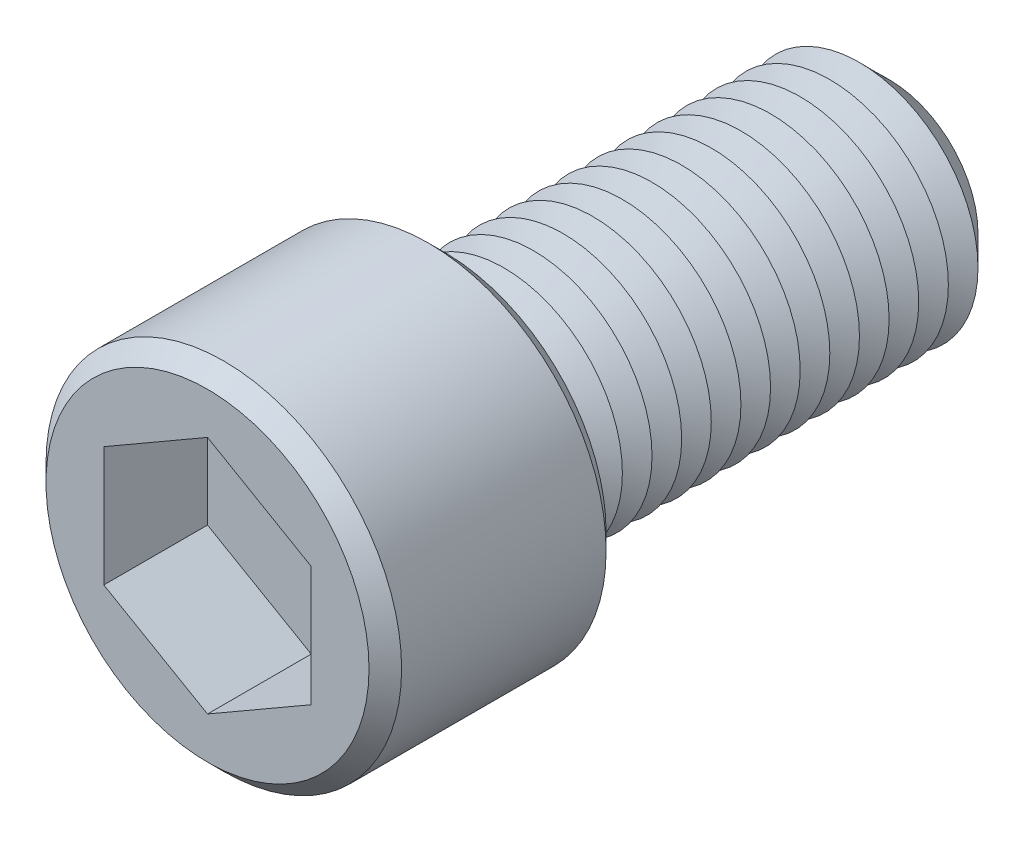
ISO-10303-21;
HEADER;
FILE_DESCRIPTION(('STEP AP214'),'2;1');
FILE_NAME('part.step','',(''),(''),'','','');
FILE_SCHEMA(('AUTOMOTIVE_DESIGN { 1 0 10303 214 1 1 1 1 }'));
ENDSEC;
DATA;
#1=APPLICATION_CONTEXT('core data for automotive mechanical design processes');
#2=APPLICATION_PROTOCOL_DEFINITION('international standard','automotive_design',2000,#1);
#3=PRODUCT_CONTEXT('',#1,'mechanical');
#4=PRODUCT('Part','Part','',(#3));
#5=PRODUCT_RELATED_PRODUCT_CATEGORY('part','',(#4));
#6=PRODUCT_DEFINITION_FORMATION('','',#4);
#7=PRODUCT_DEFINITION_CONTEXT('part definition',#1,'design');
#8=PRODUCT_DEFINITION('design','',#6,#7);
#9=PRODUCT_DEFINITION_SHAPE('','',#8);
#10=(LENGTH_UNIT() NAMED_UNIT(*) SI_UNIT(.MILLI.,.METRE.));
#11=(NAMED_UNIT(*) PLANE_ANGLE_UNIT() SI_UNIT($,.RADIAN.));
#12=(NAMED_UNIT(*) SI_UNIT($,.STERADIAN.) SOLID_ANGLE_UNIT());
#13=UNCERTAINTY_MEASURE_WITH_UNIT(LENGTH_MEASURE(1.E-05),#10,'distance_accuracy_value','');
#14=(GEOMETRIC_REPRESENTATION_CONTEXT(3) GLOBAL_UNCERTAINTY_ASSIGNED_CONTEXT((#13)) GLOBAL_UNIT_ASSIGNED_CONTEXT((#10,
#11,#12)) REPRESENTATION_CONTEXT('',''));
#15=CARTESIAN_POINT('',(0.,0.,0.));
#16=DIRECTION('',(0.,0.,1.));
#17=DIRECTION('',(1.,0.,0.));
#18=AXIS2_PLACEMENT_3D('',#15,#16,#17);
#19=CARTESIAN_POINT('',(0.,0.,16.));
#20=DIRECTION('',(0.,0.,-1.));
#21=DIRECTION('',(-1.,0.,0.));
#22=AXIS2_PLACEMENT_3D('',#19,#20,#21);
#23=CYLINDRICAL_SURFACE('',#22,12.);
#24=CARTESIAN_POINT('',(0.,0.,1.1));
#25=DIRECTION('',(0.,0.,1.));
#26=DIRECTION('',(1.,0.,0.));
#27=AXIS2_PLACEMENT_3D('',#24,#25,#26);
#28=CIRCLE('',#27,12.);
#29=CARTESIAN_POINT('',(12.,0.,1.1));
#30=VERTEX_POINT('',#29);
#31=EDGE_CURVE('E288',#30,#30,#28,.T.);
#32=ORIENTED_EDGE('',*,*,#31,.T.);
#33=EDGE_LOOP('',(#32));
#34=FACE_BOUND('',#33,.T.);
#35=CARTESIAN_POINT('',(0.,0.,14.9));
#36=DIRECTION('',(0.,0.,1.));
#37=DIRECTION('',(1.,0.,0.));
#38=AXIS2_PLACEMENT_3D('',#35,#36,#37);
#39=CIRCLE('',#38,12.);
#40=CARTESIAN_POINT('',(12.,0.,14.9));
#41=VERTEX_POINT('',#40);
#42=EDGE_CURVE('E284',#41,#41,#39,.F.);
#43=ORIENTED_EDGE('',*,*,#42,.T.);
#44=EDGE_LOOP('',(#43));
#45=FACE_BOUND('',#44,.T.);
#46=ADVANCED_FACE('F39',(#34,#45),#23,.T.);
#47=CARTESIAN_POINT('',(0.,0.,16.));
#48=DIRECTION('',(0.,0.,1.));
#49=DIRECTION('',(1.,0.,0.));
#50=AXIS2_PLACEMENT_3D('',#47,#48,#49);
#51=PLANE('',#50);
#52=CARTESIAN_POINT('',(0.,0.,16.));
#53=DIRECTION('',(0.,0.,1.));
#54=DIRECTION('',(1.,0.,0.));
#55=AXIS2_PLACEMENT_3D('',#52,#53,#54);
#56=CIRCLE('',#55,10.9);
#57=CARTESIAN_POINT('',(10.9,0.,16.));
#58=VERTEX_POINT('',#57);
#59=EDGE_CURVE('E11',#58,#58,#56,.T.);
#60=ORIENTED_EDGE('',*,*,#59,.T.);
#61=EDGE_LOOP('',(#60));
#62=FACE_BOUND('',#61,.T.);
#63=DIRECTION('',(-0.866025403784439,0.5,0.));
#64=VECTOR('',#63,1.);
#65=CARTESIAN_POINT('',(7.,4.04145188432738,16.));
#66=LINE('',#65,#64);
#67=CARTESIAN_POINT('',(7.,4.04145188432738,16.));
#68=VERTEX_POINT('',#67);
#69=CARTESIAN_POINT('',(0.,8.08290376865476,16.));
#70=VERTEX_POINT('',#69);
#71=EDGE_CURVE('E55',#68,#70,#66,.T.);
#72=ORIENTED_EDGE('',*,*,#71,.F.);
#73=DIRECTION('',(0.,1.,0.));
#74=VECTOR('',#73,1.);
#75=CARTESIAN_POINT('',(7.,-4.04145188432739,16.));
#76=LINE('',#75,#74);
#77=CARTESIAN_POINT('',(7.,-4.04145188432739,16.));
#78=VERTEX_POINT('',#77);
#79=EDGE_CURVE('E150',#78,#68,#76,.T.);
#80=ORIENTED_EDGE('',*,*,#79,.F.);
#81=DIRECTION('',(0.866025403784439,0.5,0.));
#82=VECTOR('',#81,1.);
#83=CARTESIAN_POINT('',(0.,-8.08290376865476,16.));
#84=LINE('',#83,#82);
#85=CARTESIAN_POINT('',(0.,-8.08290376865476,16.));
#86=VERTEX_POINT('',#85);
#87=EDGE_CURVE('E147',#86,#78,#84,.T.);
#88=ORIENTED_EDGE('',*,*,#87,.F.);
#89=DIRECTION('',(0.866025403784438,-0.5,0.));
#90=VECTOR('',#89,1.);
#91=CARTESIAN_POINT('',(-7.,-4.04145188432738,16.));
#92=LINE('',#91,#90);
#93=CARTESIAN_POINT('',(-7.,-4.04145188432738,16.));
#94=VERTEX_POINT('',#93);
#95=EDGE_CURVE('E103',#94,#86,#92,.T.);
#96=ORIENTED_EDGE('',*,*,#95,.F.);
#97=DIRECTION('',(0.,-1.,0.));
#98=VECTOR('',#97,1.);
#99=CARTESIAN_POINT('',(-7.,4.04145188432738,16.));
#100=LINE('',#99,#98);
#101=CARTESIAN_POINT('',(-7.,4.04145188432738,16.));
#102=VERTEX_POINT('',#101);
#103=EDGE_CURVE('E141',#102,#94,#100,.T.);
#104=ORIENTED_EDGE('',*,*,#103,.F.);
#105=DIRECTION('',(-0.866025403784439,-0.5,0.));
#106=VECTOR('',#105,1.);
#107=CARTESIAN_POINT('',(0.,8.08290376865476,16.));
#108=LINE('',#107,#106);
#109=EDGE_CURVE('E136',#70,#102,#108,.T.);
#110=ORIENTED_EDGE('',*,*,#109,.F.);
#111=EDGE_LOOP('',(#72,#80,#88,#96,#104,#110));
#112=FACE_BOUND('',#111,.T.);
#113=ADVANCED_FACE('F306',(#62,#112),#51,.T.);
#114=CARTESIAN_POINT('',(0.,0.,0.));
#115=DIRECTION('',(0.,0.,1.));
#116=DIRECTION('',(1.,0.,0.));
#117=AXIS2_PLACEMENT_3D('',#114,#115,#116);
#118=PLANE('',#117);
#119=CARTESIAN_POINT('',(0.,0.,0.));
#120=DIRECTION('',(0.,0.,1.));
#121=DIRECTION('',(1.,0.,0.));
#122=AXIS2_PLACEMENT_3D('',#119,#120,#121);
#123=CIRCLE('',#122,10.9);
#124=CARTESIAN_POINT('',(10.9,0.,0.));
#125=VERTEX_POINT('',#124);
#126=EDGE_CURVE('E48',#125,#125,#123,.F.);
#127=ORIENTED_EDGE('',*,*,#126,.T.);
#128=EDGE_LOOP('',(#127));
#129=FACE_BOUND('',#128,.T.);
#130=CARTESIAN_POINT('',(0.,0.,0.));
#131=DIRECTION('',(0.,0.,1.));
#132=DIRECTION('',(1.,0.,0.));
#133=AXIS2_PLACEMENT_3D('',#130,#131,#132);
#134=CIRCLE('',#133,8.);
#135=CARTESIAN_POINT('',(8.,0.,0.));
#136=VERTEX_POINT('',#135);
#137=EDGE_CURVE('E276',#136,#136,#134,.T.);
#138=ORIENTED_EDGE('',*,*,#137,.T.);
#139=EDGE_LOOP('',(#138));
#140=FACE_BOUND('',#139,.T.);
#141=ADVANCED_FACE('F295',(#129,#140),#118,.F.);
#142=CARTESIAN_POINT('',(0.,0.,0.));
#143=DIRECTION('',(0.,0.,1.));
#144=DIRECTION('',(1.,0.,0.));
#145=AXIS2_PLACEMENT_3D('',#142,#143,#144);
#146=CONICAL_SURFACE('',#145,8.,1.0471975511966);
#147=CARTESIAN_POINT('',(0.,0.,-1.));
#148=DIRECTION('',(0.,0.,1.));
#149=DIRECTION('',(1.,0.,0.));
#150=AXIS2_PLACEMENT_3D('',#147,#148,#149);
#151=CIRCLE('',#150,6.26794919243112);
#152=CARTESIAN_POINT('',(6.26794919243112,0.,-1.));
#153=VERTEX_POINT('',#152);
#154=EDGE_CURVE('E272',#153,#153,#151,.T.);
#155=ORIENTED_EDGE('',*,*,#154,.T.);
#156=EDGE_LOOP('',(#155));
#157=FACE_BOUND('',#156,.T.);
#158=ORIENTED_EDGE('',*,*,#137,.F.);
#159=EDGE_LOOP('',(#158));
#160=FACE_BOUND('',#159,.T.);
#161=ADVANCED_FACE('F468',(#157,#160),#146,.T.);
#162=CARTESIAN_POINT('',(0.,0.,-1.));
#163=DIRECTION('',(0.,0.,-1.));
#164=DIRECTION('',(-1.,0.,0.));
#165=AXIS2_PLACEMENT_3D('',#162,#163,#164);
#166=CONICAL_SURFACE('',#165,6.26794919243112,1.0471975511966);
#167=CARTESIAN_POINT('',(0.,0.,-2.));
#168=DIRECTION('',(0.,0.,1.));
#169=DIRECTION('',(1.,0.,0.));
#170=AXIS2_PLACEMENT_3D('',#167,#168,#169);
#171=CIRCLE('',#170,8.);
#172=CARTESIAN_POINT('',(8.,0.,-2.));
#173=VERTEX_POINT('',#172);
#174=EDGE_CURVE('E268',#173,#173,#171,.T.);
#175=ORIENTED_EDGE('',*,*,#174,.T.);
#176=EDGE_LOOP('',(#175));
#177=FACE_BOUND('',#176,.T.);
#178=ORIENTED_EDGE('',*,*,#154,.F.);
#179=EDGE_LOOP('',(#178));
#180=FACE_BOUND('',#179,.T.);
#181=ADVANCED_FACE('F464',(#177,#180),#166,.T.);
#182=CARTESIAN_POINT('',(0.,0.,-2.));
#183=DIRECTION('',(0.,0.,1.));
#184=DIRECTION('',(1.,0.,0.));
#185=AXIS2_PLACEMENT_3D('',#182,#183,#184);
#186=CONICAL_SURFACE('',#185,8.,1.0471975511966);
#187=CARTESIAN_POINT('',(0.,0.,-3.));
#188=DIRECTION('',(0.,0.,1.));
#189=DIRECTION('',(1.,0.,0.));
#190=AXIS2_PLACEMENT_3D('',#187,#188,#189);
#191=CIRCLE('',#190,6.26794919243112);
#192=CARTESIAN_POINT('',(6.26794919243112,0.,-3.));
#193=VERTEX_POINT('',#192);
#194=EDGE_CURVE('E264',#193,#193,#191,.T.);
#195=ORIENTED_EDGE('',*,*,#194,.T.);
#196=EDGE_LOOP('',(#195));
#197=FACE_BOUND('',#196,.T.);
#198=ORIENTED_EDGE('',*,*,#174,.F.);
#199=EDGE_LOOP('',(#198));
#200=FACE_BOUND('',#199,.T.);
#201=ADVANCED_FACE('F460',(#197,#200),#186,.T.);
#202=CARTESIAN_POINT('',(0.,0.,-3.));
#203=DIRECTION('',(0.,0.,-1.));
#204=DIRECTION('',(-1.,0.,0.));
#205=AXIS2_PLACEMENT_3D('',#202,#203,#204);
#206=CONICAL_SURFACE('',#205,6.26794919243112,1.0471975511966);
#207=CARTESIAN_POINT('',(0.,0.,-4.));
#208=DIRECTION('',(0.,0.,1.));
#209=DIRECTION('',(1.,0.,0.));
#210=AXIS2_PLACEMENT_3D('',#207,#208,#209);
#211=CIRCLE('',#210,8.);
#212=CARTESIAN_POINT('',(8.,0.,-4.));
#213=VERTEX_POINT('',#212);
#214=EDGE_CURVE('E260',#213,#213,#211,.T.);
#215=ORIENTED_EDGE('',*,*,#214,.T.);
#216=EDGE_LOOP('',(#215));
#217=FACE_BOUND('',#216,.T.);
#218=ORIENTED_EDGE('',*,*,#194,.F.);
#219=EDGE_LOOP('',(#218));
#220=FACE_BOUND('',#219,.T.);
#221=ADVANCED_FACE('F456',(#217,#220),#206,.T.);
#222=CARTESIAN_POINT('',(0.,0.,-4.));
#223=DIRECTION('',(0.,0.,1.));
#224=DIRECTION('',(1.,0.,0.));
#225=AXIS2_PLACEMENT_3D('',#222,#223,#224);
#226=CONICAL_SURFACE('',#225,8.,1.0471975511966);
#227=CARTESIAN_POINT('',(0.,0.,-5.));
#228=DIRECTION('',(0.,0.,1.));
#229=DIRECTION('',(1.,0.,0.));
#230=AXIS2_PLACEMENT_3D('',#227,#228,#229);
#231=CIRCLE('',#230,6.26794919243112);
#232=CARTESIAN_POINT('',(6.26794919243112,0.,-5.));
#233=VERTEX_POINT('',#232);
#234=EDGE_CURVE('E256',#233,#233,#231,.T.);
#235=ORIENTED_EDGE('',*,*,#234,.T.);
#236=EDGE_LOOP('',(#235));
#237=FACE_BOUND('',#236,.T.);
#238=ORIENTED_EDGE('',*,*,#214,.F.);
#239=EDGE_LOOP('',(#238));
#240=FACE_BOUND('',#239,.T.);
#241=ADVANCED_FACE('F452',(#237,#240),#226,.T.);
#242=CARTESIAN_POINT('',(0.,0.,-5.));
#243=DIRECTION('',(0.,0.,-1.));
#244=DIRECTION('',(-1.,0.,0.));
#245=AXIS2_PLACEMENT_3D('',#242,#243,#244);
#246=CONICAL_SURFACE('',#245,6.26794919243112,1.0471975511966);
#247=CARTESIAN_POINT('',(0.,0.,-6.));
#248=DIRECTION('',(0.,0.,1.));
#249=DIRECTION('',(1.,0.,0.));
#250=AXIS2_PLACEMENT_3D('',#247,#248,#249);
#251=CIRCLE('',#250,8.);
#252=CARTESIAN_POINT('',(8.,0.,-6.));
#253=VERTEX_POINT('',#252);
#254=EDGE_CURVE('E252',#253,#253,#251,.T.);
#255=ORIENTED_EDGE('',*,*,#254,.T.);
#256=EDGE_LOOP('',(#255));
#257=FACE_BOUND('',#256,.T.);
#258=ORIENTED_EDGE('',*,*,#234,.F.);
#259=EDGE_LOOP('',(#258));
#260=FACE_BOUND('',#259,.T.);
#261=ADVANCED_FACE('F448',(#257,#260),#246,.T.);
#262=CARTESIAN_POINT('',(0.,0.,-6.));
#263=DIRECTION('',(0.,0.,1.));
#264=DIRECTION('',(1.,0.,0.));
#265=AXIS2_PLACEMENT_3D('',#262,#263,#264);
#266=CONICAL_SURFACE('',#265,8.,1.0471975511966);
#267=CARTESIAN_POINT('',(0.,0.,-7.));
#268=DIRECTION('',(0.,0.,1.));
#269=DIRECTION('',(1.,0.,0.));
#270=AXIS2_PLACEMENT_3D('',#267,#268,#269);
#271=CIRCLE('',#270,6.26794919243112);
#272=CARTESIAN_POINT('',(6.26794919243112,0.,-7.));
#273=VERTEX_POINT('',#272);
#274=EDGE_CURVE('E248',#273,#273,#271,.T.);
#275=ORIENTED_EDGE('',*,*,#274,.T.);
#276=EDGE_LOOP('',(#275));
#277=FACE_BOUND('',#276,.T.);
#278=ORIENTED_EDGE('',*,*,#254,.F.);
#279=EDGE_LOOP('',(#278));
#280=FACE_BOUND('',#279,.T.);
#281=ADVANCED_FACE('F444',(#277,#280),#266,.T.);
#282=CARTESIAN_POINT('',(0.,0.,-7.));
#283=DIRECTION('',(0.,0.,-1.));
#284=DIRECTION('',(-1.,0.,0.));
#285=AXIS2_PLACEMENT_3D('',#282,#283,#284);
#286=CONICAL_SURFACE('',#285,6.26794919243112,1.0471975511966);
#287=CARTESIAN_POINT('',(0.,0.,-8.));
#288=DIRECTION('',(0.,0.,1.));
#289=DIRECTION('',(1.,0.,0.));
#290=AXIS2_PLACEMENT_3D('',#287,#288,#289);
#291=CIRCLE('',#290,8.);
#292=CARTESIAN_POINT('',(8.,0.,-8.));
#293=VERTEX_POINT('',#292);
#294=EDGE_CURVE('E244',#293,#293,#291,.T.);
#295=ORIENTED_EDGE('',*,*,#294,.T.);
#296=EDGE_LOOP('',(#295));
#297=FACE_BOUND('',#296,.T.);
#298=ORIENTED_EDGE('',*,*,#274,.F.);
#299=EDGE_LOOP('',(#298));
#300=FACE_BOUND('',#299,.T.);
#301=ADVANCED_FACE('F440',(#297,#300),#286,.T.);
#302=CARTESIAN_POINT('',(0.,0.,-8.));
#303=DIRECTION('',(0.,0.,1.));
#304=DIRECTION('',(1.,0.,0.));
#305=AXIS2_PLACEMENT_3D('',#302,#303,#304);
#306=CONICAL_SURFACE('',#305,8.,1.0471975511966);
#307=CARTESIAN_POINT('',(0.,0.,-9.));
#308=DIRECTION('',(0.,0.,1.));
#309=DIRECTION('',(1.,0.,0.));
#310=AXIS2_PLACEMENT_3D('',#307,#308,#309);
#311=CIRCLE('',#310,6.26794919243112);
#312=CARTESIAN_POINT('',(6.26794919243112,0.,-9.));
#313=VERTEX_POINT('',#312);
#314=EDGE_CURVE('E240',#313,#313,#311,.T.);
#315=ORIENTED_EDGE('',*,*,#314,.T.);
#316=EDGE_LOOP('',(#315));
#317=FACE_BOUND('',#316,.T.);
#318=ORIENTED_EDGE('',*,*,#294,.F.);
#319=EDGE_LOOP('',(#318));
#320=FACE_BOUND('',#319,.T.);
#321=ADVANCED_FACE('F436',(#317,#320),#306,.T.);
#322=CARTESIAN_POINT('',(0.,0.,-9.));
#323=DIRECTION('',(0.,0.,-1.));
#324=DIRECTION('',(-1.,0.,0.));
#325=AXIS2_PLACEMENT_3D('',#322,#323,#324);
#326=CONICAL_SURFACE('',#325,6.26794919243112,1.0471975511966);
#327=CARTESIAN_POINT('',(0.,0.,-10.));
#328=DIRECTION('',(0.,0.,1.));
#329=DIRECTION('',(1.,0.,0.));
#330=AXIS2_PLACEMENT_3D('',#327,#328,#329);
#331=CIRCLE('',#330,8.);
#332=CARTESIAN_POINT('',(8.,0.,-10.));
#333=VERTEX_POINT('',#332);
#334=EDGE_CURVE('E236',#333,#333,#331,.T.);
#335=ORIENTED_EDGE('',*,*,#334,.T.);
#336=EDGE_LOOP('',(#335));
#337=FACE_BOUND('',#336,.T.);
#338=ORIENTED_EDGE('',*,*,#314,.F.);
#339=EDGE_LOOP('',(#338));
#340=FACE_BOUND('',#339,.T.);
#341=ADVANCED_FACE('F432',(#337,#340),#326,.T.);
#342=CARTESIAN_POINT('',(0.,0.,-10.));
#343=DIRECTION('',(0.,0.,1.));
#344=DIRECTION('',(1.,0.,0.));
#345=AXIS2_PLACEMENT_3D('',#342,#343,#344);
#346=CONICAL_SURFACE('',#345,8.,1.0471975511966);
#347=CARTESIAN_POINT('',(0.,0.,-11.));
#348=DIRECTION('',(0.,0.,1.));
#349=DIRECTION('',(1.,0.,0.));
#350=AXIS2_PLACEMENT_3D('',#347,#348,#349);
#351=CIRCLE('',#350,6.26794919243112);
#352=CARTESIAN_POINT('',(6.26794919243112,0.,-11.));
#353=VERTEX_POINT('',#352);
#354=EDGE_CURVE('E232',#353,#353,#351,.T.);
#355=ORIENTED_EDGE('',*,*,#354,.T.);
#356=EDGE_LOOP('',(#355));
#357=FACE_BOUND('',#356,.T.);
#358=ORIENTED_EDGE('',*,*,#334,.F.);
#359=EDGE_LOOP('',(#358));
#360=FACE_BOUND('',#359,.T.);
#361=ADVANCED_FACE('F428',(#357,#360),#346,.T.);
#362=CARTESIAN_POINT('',(0.,0.,-11.));
#363=DIRECTION('',(0.,0.,-1.));
#364=DIRECTION('',(-1.,0.,0.));
#365=AXIS2_PLACEMENT_3D('',#362,#363,#364);
#366=CONICAL_SURFACE('',#365,6.26794919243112,1.0471975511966);
#367=CARTESIAN_POINT('',(0.,0.,-12.));
#368=DIRECTION('',(0.,0.,1.));
#369=DIRECTION('',(1.,0.,0.));
#370=AXIS2_PLACEMENT_3D('',#367,#368,#369);
#371=CIRCLE('',#370,8.);
#372=CARTESIAN_POINT('',(8.,0.,-12.));
#373=VERTEX_POINT('',#372);
#374=EDGE_CURVE('E228',#373,#373,#371,.T.);
#375=ORIENTED_EDGE('',*,*,#374,.T.);
#376=EDGE_LOOP('',(#375));
#377=FACE_BOUND('',#376,.T.);
#378=ORIENTED_EDGE('',*,*,#354,.F.);
#379=EDGE_LOOP('',(#378));
#380=FACE_BOUND('',#379,.T.);
#381=ADVANCED_FACE('F424',(#377,#380),#366,.T.);
#382=CARTESIAN_POINT('',(0.,0.,-12.));
#383=DIRECTION('',(0.,0.,1.));
#384=DIRECTION('',(1.,0.,0.));
#385=AXIS2_PLACEMENT_3D('',#382,#383,#384);
#386=CONICAL_SURFACE('',#385,8.,1.0471975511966);
#387=CARTESIAN_POINT('',(0.,0.,-13.));
#388=DIRECTION('',(0.,0.,1.));
#389=DIRECTION('',(1.,0.,0.));
#390=AXIS2_PLACEMENT_3D('',#387,#388,#389);
#391=CIRCLE('',#390,6.26794919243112);
#392=CARTESIAN_POINT('',(6.26794919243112,0.,-13.));
#393=VERTEX_POINT('',#392);
#394=EDGE_CURVE('E224',#393,#393,#391,.T.);
#395=ORIENTED_EDGE('',*,*,#394,.T.);
#396=EDGE_LOOP('',(#395));
#397=FACE_BOUND('',#396,.T.);
#398=ORIENTED_EDGE('',*,*,#374,.F.);
#399=EDGE_LOOP('',(#398));
#400=FACE_BOUND('',#399,.T.);
#401=ADVANCED_FACE('F420',(#397,#400),#386,.T.);
#402=CARTESIAN_POINT('',(0.,0.,-13.));
#403=DIRECTION('',(0.,0.,-1.));
#404=DIRECTION('',(-1.,0.,0.));
#405=AXIS2_PLACEMENT_3D('',#402,#403,#404);
#406=CONICAL_SURFACE('',#405,6.26794919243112,1.0471975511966);
#407=CARTESIAN_POINT('',(0.,0.,-14.));
#408=DIRECTION('',(0.,0.,1.));
#409=DIRECTION('',(1.,0.,0.));
#410=AXIS2_PLACEMENT_3D('',#407,#408,#409);
#411=CIRCLE('',#410,8.);
#412=CARTESIAN_POINT('',(8.,0.,-14.));
#413=VERTEX_POINT('',#412);
#414=EDGE_CURVE('E220',#413,#413,#411,.T.);
#415=ORIENTED_EDGE('',*,*,#414,.T.);
#416=EDGE_LOOP('',(#415));
#417=FACE_BOUND('',#416,.T.);
#418=ORIENTED_EDGE('',*,*,#394,.F.);
#419=EDGE_LOOP('',(#418));
#420=FACE_BOUND('',#419,.T.);
#421=ADVANCED_FACE('F416',(#417,#420),#406,.T.);
#422=CARTESIAN_POINT('',(0.,0.,-14.));
#423=DIRECTION('',(0.,0.,1.));
#424=DIRECTION('',(1.,0.,0.));
#425=AXIS2_PLACEMENT_3D('',#422,#423,#424);
#426=CONICAL_SURFACE('',#425,8.,1.0471975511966);
#427=CARTESIAN_POINT('',(0.,0.,-15.));
#428=DIRECTION('',(0.,0.,1.));
#429=DIRECTION('',(1.,0.,0.));
#430=AXIS2_PLACEMENT_3D('',#427,#428,#429);
#431=CIRCLE('',#430,6.26794919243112);
#432=CARTESIAN_POINT('',(6.26794919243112,0.,-15.));
#433=VERTEX_POINT('',#432);
#434=EDGE_CURVE('E216',#433,#433,#431,.T.);
#435=ORIENTED_EDGE('',*,*,#434,.T.);
#436=EDGE_LOOP('',(#435));
#437=FACE_BOUND('',#436,.T.);
#438=ORIENTED_EDGE('',*,*,#414,.F.);
#439=EDGE_LOOP('',(#438));
#440=FACE_BOUND('',#439,.T.);
#441=ADVANCED_FACE('F412',(#437,#440),#426,.T.);
#442=CARTESIAN_POINT('',(0.,0.,-15.));
#443=DIRECTION('',(0.,0.,-1.));
#444=DIRECTION('',(-1.,0.,0.));
#445=AXIS2_PLACEMENT_3D('',#442,#443,#444);
#446=CONICAL_SURFACE('',#445,6.26794919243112,1.0471975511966);
#447=CARTESIAN_POINT('',(0.,0.,-16.));
#448=DIRECTION('',(0.,0.,1.));
#449=DIRECTION('',(1.,0.,0.));
#450=AXIS2_PLACEMENT_3D('',#447,#448,#449);
#451=CIRCLE('',#450,8.);
#452=CARTESIAN_POINT('',(8.,0.,-16.));
#453=VERTEX_POINT('',#452);
#454=EDGE_CURVE('E212',#453,#453,#451,.T.);
#455=ORIENTED_EDGE('',*,*,#454,.T.);
#456=EDGE_LOOP('',(#455));
#457=FACE_BOUND('',#456,.T.);
#458=ORIENTED_EDGE('',*,*,#434,.F.);
#459=EDGE_LOOP('',(#458));
#460=FACE_BOUND('',#459,.T.);
#461=ADVANCED_FACE('F408',(#457,#460),#446,.T.);
#462=CARTESIAN_POINT('',(0.,0.,-16.));
#463=DIRECTION('',(0.,0.,1.));
#464=DIRECTION('',(1.,0.,0.));
#465=AXIS2_PLACEMENT_3D('',#462,#463,#464);
#466=CONICAL_SURFACE('',#465,8.,1.0471975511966);
#467=CARTESIAN_POINT('',(0.,0.,-17.));
#468=DIRECTION('',(0.,0.,1.));
#469=DIRECTION('',(1.,0.,0.));
#470=AXIS2_PLACEMENT_3D('',#467,#468,#469);
#471=CIRCLE('',#470,6.26794919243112);
#472=CARTESIAN_POINT('',(6.26794919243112,0.,-17.));
#473=VERTEX_POINT('',#472);
#474=EDGE_CURVE('E208',#473,#473,#471,.T.);
#475=ORIENTED_EDGE('',*,*,#474,.T.);
#476=EDGE_LOOP('',(#475));
#477=FACE_BOUND('',#476,.T.);
#478=ORIENTED_EDGE('',*,*,#454,.F.);
#479=EDGE_LOOP('',(#478));
#480=FACE_BOUND('',#479,.T.);
#481=ADVANCED_FACE('F404',(#477,#480),#466,.T.);
#482=CARTESIAN_POINT('',(0.,0.,-17.));
#483=DIRECTION('',(0.,0.,-1.));
#484=DIRECTION('',(-1.,0.,0.));
#485=AXIS2_PLACEMENT_3D('',#482,#483,#484);
#486=CONICAL_SURFACE('',#485,6.26794919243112,1.0471975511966);
#487=CARTESIAN_POINT('',(0.,0.,-18.));
#488=DIRECTION('',(0.,0.,1.));
#489=DIRECTION('',(1.,0.,0.));
#490=AXIS2_PLACEMENT_3D('',#487,#488,#489);
#491=CIRCLE('',#490,8.);
#492=CARTESIAN_POINT('',(8.,0.,-18.));
#493=VERTEX_POINT('',#492);
#494=EDGE_CURVE('E204',#493,#493,#491,.T.);
#495=ORIENTED_EDGE('',*,*,#494,.T.);
#496=EDGE_LOOP('',(#495));
#497=FACE_BOUND('',#496,.T.);
#498=ORIENTED_EDGE('',*,*,#474,.F.);
#499=EDGE_LOOP('',(#498));
#500=FACE_BOUND('',#499,.T.);
#501=ADVANCED_FACE('F400',(#497,#500),#486,.T.);
#502=CARTESIAN_POINT('',(0.,0.,-18.));
#503=DIRECTION('',(0.,0.,1.));
#504=DIRECTION('',(1.,0.,0.));
#505=AXIS2_PLACEMENT_3D('',#502,#503,#504);
#506=CONICAL_SURFACE('',#505,8.,1.0471975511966);
#507=CARTESIAN_POINT('',(0.,0.,-19.));
#508=DIRECTION('',(0.,0.,1.));
#509=DIRECTION('',(1.,0.,0.));
#510=AXIS2_PLACEMENT_3D('',#507,#508,#509);
#511=CIRCLE('',#510,6.26794919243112);
#512=CARTESIAN_POINT('',(6.26794919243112,0.,-19.));
#513=VERTEX_POINT('',#512);
#514=EDGE_CURVE('E200',#513,#513,#511,.T.);
#515=ORIENTED_EDGE('',*,*,#514,.T.);
#516=EDGE_LOOP('',(#515));
#517=FACE_BOUND('',#516,.T.);
#518=ORIENTED_EDGE('',*,*,#494,.F.);
#519=EDGE_LOOP('',(#518));
#520=FACE_BOUND('',#519,.T.);
#521=ADVANCED_FACE('F396',(#517,#520),#506,.T.);
#522=CARTESIAN_POINT('',(0.,0.,-19.));
#523=DIRECTION('',(0.,0.,-1.));
#524=DIRECTION('',(-1.,0.,0.));
#525=AXIS2_PLACEMENT_3D('',#522,#523,#524);
#526=CONICAL_SURFACE('',#525,6.26794919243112,1.0471975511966);
#527=CARTESIAN_POINT('',(0.,0.,-20.));
#528=DIRECTION('',(0.,0.,1.));
#529=DIRECTION('',(1.,0.,0.));
#530=AXIS2_PLACEMENT_3D('',#527,#528,#529);
#531=CIRCLE('',#530,8.);
#532=CARTESIAN_POINT('',(8.,0.,-20.));
#533=VERTEX_POINT('',#532);
#534=EDGE_CURVE('E196',#533,#533,#531,.T.);
#535=ORIENTED_EDGE('',*,*,#534,.T.);
#536=EDGE_LOOP('',(#535));
#537=FACE_BOUND('',#536,.T.);
#538=ORIENTED_EDGE('',*,*,#514,.F.);
#539=EDGE_LOOP('',(#538));
#540=FACE_BOUND('',#539,.T.);
#541=ADVANCED_FACE('F392',(#537,#540),#526,.T.);
#542=CARTESIAN_POINT('',(0.,0.,-20.));
#543=DIRECTION('',(0.,0.,1.));
#544=DIRECTION('',(1.,0.,0.));
#545=AXIS2_PLACEMENT_3D('',#542,#543,#544);
#546=CONICAL_SURFACE('',#545,8.,1.0471975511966);
#547=CARTESIAN_POINT('',(0.,0.,-21.));
#548=DIRECTION('',(0.,0.,1.));
#549=DIRECTION('',(1.,0.,0.));
#550=AXIS2_PLACEMENT_3D('',#547,#548,#549);
#551=CIRCLE('',#550,6.26794919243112);
#552=CARTESIAN_POINT('',(6.26794919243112,0.,-21.));
#553=VERTEX_POINT('',#552);
#554=EDGE_CURVE('E192',#553,#553,#551,.T.);
#555=ORIENTED_EDGE('',*,*,#554,.T.);
#556=EDGE_LOOP('',(#555));
#557=FACE_BOUND('',#556,.T.);
#558=ORIENTED_EDGE('',*,*,#534,.F.);
#559=EDGE_LOOP('',(#558));
#560=FACE_BOUND('',#559,.T.);
#561=ADVANCED_FACE('F388',(#557,#560),#546,.T.);
#562=CARTESIAN_POINT('',(0.,0.,-21.));
#563=DIRECTION('',(0.,0.,-1.));
#564=DIRECTION('',(-1.,0.,0.));
#565=AXIS2_PLACEMENT_3D('',#562,#563,#564);
#566=CONICAL_SURFACE('',#565,6.26794919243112,1.0471975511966);
#567=CARTESIAN_POINT('',(0.,0.,-22.));
#568=DIRECTION('',(0.,0.,1.));
#569=DIRECTION('',(1.,0.,0.));
#570=AXIS2_PLACEMENT_3D('',#567,#568,#569);
#571=CIRCLE('',#570,8.);
#572=CARTESIAN_POINT('',(8.,0.,-22.));
#573=VERTEX_POINT('',#572);
#574=EDGE_CURVE('E189',#573,#573,#571,.T.);
#575=ORIENTED_EDGE('',*,*,#574,.T.);
#576=EDGE_LOOP('',(#575));
#577=FACE_BOUND('',#576,.T.);
#578=ORIENTED_EDGE('',*,*,#554,.F.);
#579=EDGE_LOOP('',(#578));
#580=FACE_BOUND('',#579,.T.);
#581=ADVANCED_FACE('F384',(#577,#580),#566,.T.);
#582=CARTESIAN_POINT('',(0.,0.,-22.));
#583=DIRECTION('',(0.,0.,1.));
#584=DIRECTION('',(1.,0.,0.));
#585=AXIS2_PLACEMENT_3D('',#582,#583,#584);
#586=CONICAL_SURFACE('',#585,8.,1.0471975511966);
#587=CARTESIAN_POINT('',(0.,0.,-23.));
#588=DIRECTION('',(0.,0.,1.));
#589=DIRECTION('',(1.,0.,0.));
#590=AXIS2_PLACEMENT_3D('',#587,#588,#589);
#591=CIRCLE('',#590,6.26794919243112);
#592=CARTESIAN_POINT('',(6.26794919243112,0.,-23.));
#593=VERTEX_POINT('',#592);
#594=EDGE_CURVE('E185',#593,#593,#591,.T.);
#595=ORIENTED_EDGE('',*,*,#594,.T.);
#596=EDGE_LOOP('',(#595));
#597=FACE_BOUND('',#596,.T.);
#598=ORIENTED_EDGE('',*,*,#574,.F.);
#599=EDGE_LOOP('',(#598));
#600=FACE_BOUND('',#599,.T.);
#601=ADVANCED_FACE('F380',(#597,#600),#586,.T.);
#602=CARTESIAN_POINT('',(0.,0.,-23.));
#603=DIRECTION('',(0.,0.,-1.));
#604=DIRECTION('',(-1.,0.,0.));
#605=AXIS2_PLACEMENT_3D('',#602,#603,#604);
#606=CONICAL_SURFACE('',#605,6.26794919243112,1.0471975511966);
#607=CARTESIAN_POINT('',(0.,0.,-24.));
#608=DIRECTION('',(0.,0.,1.));
#609=DIRECTION('',(1.,0.,0.));
#610=AXIS2_PLACEMENT_3D('',#607,#608,#609);
#611=CIRCLE('',#610,8.);
#612=CARTESIAN_POINT('',(8.,0.,-24.));
#613=VERTEX_POINT('',#612);
#614=EDGE_CURVE('E181',#613,#613,#611,.T.);
#615=ORIENTED_EDGE('',*,*,#614,.T.);
#616=EDGE_LOOP('',(#615));
#617=FACE_BOUND('',#616,.T.);
#618=ORIENTED_EDGE('',*,*,#594,.F.);
#619=EDGE_LOOP('',(#618));
#620=FACE_BOUND('',#619,.T.);
#621=ADVANCED_FACE('F376',(#617,#620),#606,.T.);
#622=CARTESIAN_POINT('',(0.,0.,-24.));
#623=DIRECTION('',(0.,0.,1.));
#624=DIRECTION('',(1.,0.,0.));
#625=AXIS2_PLACEMENT_3D('',#622,#623,#624);
#626=CONICAL_SURFACE('',#625,8.,1.0471975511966);
#627=CARTESIAN_POINT('',(0.,0.,-25.));
#628=DIRECTION('',(0.,0.,1.));
#629=DIRECTION('',(1.,0.,0.));
#630=AXIS2_PLACEMENT_3D('',#627,#628,#629);
#631=CIRCLE('',#630,6.26794919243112);
#632=CARTESIAN_POINT('',(6.26794919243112,0.,-25.));
#633=VERTEX_POINT('',#632);
#634=EDGE_CURVE('E177',#633,#633,#631,.T.);
#635=ORIENTED_EDGE('',*,*,#634,.T.);
#636=EDGE_LOOP('',(#635));
#637=FACE_BOUND('',#636,.T.);
#638=ORIENTED_EDGE('',*,*,#614,.F.);
#639=EDGE_LOOP('',(#638));
#640=FACE_BOUND('',#639,.T.);
#641=ADVANCED_FACE('F372',(#637,#640),#626,.T.);
#642=CARTESIAN_POINT('',(0.,0.,-25.));
#643=DIRECTION('',(0.,0.,-1.));
#644=DIRECTION('',(-1.,0.,0.));
#645=AXIS2_PLACEMENT_3D('',#642,#643,#644);
#646=CONICAL_SURFACE('',#645,6.26794919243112,1.0471975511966);
#647=CARTESIAN_POINT('',(0.,0.,-26.));
#648=DIRECTION('',(0.,0.,1.));
#649=DIRECTION('',(1.,0.,0.));
#650=AXIS2_PLACEMENT_3D('',#647,#648,#649);
#651=CIRCLE('',#650,8.);
#652=CARTESIAN_POINT('',(8.,0.,-26.));
#653=VERTEX_POINT('',#652);
#654=EDGE_CURVE('E173',#653,#653,#651,.T.);
#655=ORIENTED_EDGE('',*,*,#654,.T.);
#656=EDGE_LOOP('',(#655));
#657=FACE_BOUND('',#656,.T.);
#658=ORIENTED_EDGE('',*,*,#634,.F.);
#659=EDGE_LOOP('',(#658));
#660=FACE_BOUND('',#659,.T.);
#661=ADVANCED_FACE('F368',(#657,#660),#646,.T.);
#662=CARTESIAN_POINT('',(0.,0.,-26.));
#663=DIRECTION('',(0.,0.,1.));
#664=DIRECTION('',(1.,0.,0.));
#665=AXIS2_PLACEMENT_3D('',#662,#663,#664);
#666=CONICAL_SURFACE('',#665,8.,1.0471975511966);
#667=CARTESIAN_POINT('',(0.,0.,-27.));
#668=DIRECTION('',(0.,0.,1.));
#669=DIRECTION('',(1.,0.,0.));
#670=AXIS2_PLACEMENT_3D('',#667,#668,#669);
#671=CIRCLE('',#670,6.26794919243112);
#672=CARTESIAN_POINT('',(6.26794919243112,0.,-27.));
#673=VERTEX_POINT('',#672);
#674=EDGE_CURVE('E169',#673,#673,#671,.T.);
#675=ORIENTED_EDGE('',*,*,#674,.T.);
#676=EDGE_LOOP('',(#675));
#677=FACE_BOUND('',#676,.T.);
#678=ORIENTED_EDGE('',*,*,#654,.F.);
#679=EDGE_LOOP('',(#678));
#680=FACE_BOUND('',#679,.T.);
#681=ADVANCED_FACE('F364',(#677,#680),#666,.T.);
#682=CARTESIAN_POINT('',(0.,0.,-27.));
#683=DIRECTION('',(0.,0.,-1.));
#684=DIRECTION('',(-1.,0.,0.));
#685=AXIS2_PLACEMENT_3D('',#682,#683,#684);
#686=CONICAL_SURFACE('',#685,6.26794919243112,1.0471975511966);
#687=CARTESIAN_POINT('',(0.,0.,-28.));
#688=DIRECTION('',(0.,0.,1.));
#689=DIRECTION('',(1.,0.,0.));
#690=AXIS2_PLACEMENT_3D('',#687,#688,#689);
#691=CIRCLE('',#690,8.);
#692=CARTESIAN_POINT('',(8.,0.,-28.));
#693=VERTEX_POINT('',#692);
#694=EDGE_CURVE('E156',#693,#693,#691,.T.);
#695=ORIENTED_EDGE('',*,*,#694,.T.);
#696=EDGE_LOOP('',(#695));
#697=FACE_BOUND('',#696,.T.);
#698=ORIENTED_EDGE('',*,*,#674,.F.);
#699=EDGE_LOOP('',(#698));
#700=FACE_BOUND('',#699,.T.);
#701=ADVANCED_FACE('F360',(#697,#700),#686,.T.);
#702=CARTESIAN_POINT('',(0.,0.,-30.));
#703=DIRECTION('',(0.,0.,-1.));
#704=DIRECTION('',(-1.,0.,0.));
#705=AXIS2_PLACEMENT_3D('',#702,#703,#704);
#706=PLANE('',#705);
#707=CARTESIAN_POINT('',(0.,0.,-30.));
#708=DIRECTION('',(0.,0.,-1.));
#709=DIRECTION('',(-1.,0.,0.));
#710=AXIS2_PLACEMENT_3D('',#707,#708,#709);
#711=CIRCLE('',#710,0.9);
#712=CARTESIAN_POINT('',(-0.9,0.,-30.));
#713=VERTEX_POINT('',#712);
#714=EDGE_CURVE('E137',#713,#713,#711,.F.);
#715=ORIENTED_EDGE('',*,*,#714,.T.);
#716=EDGE_LOOP('',(#715));
#717=FACE_BOUND('',#716,.T.);
#718=CARTESIAN_POINT('',(0.,0.,-30.));
#719=DIRECTION('',(0.,0.,-1.));
#720=DIRECTION('',(-1.,0.,0.));
#721=AXIS2_PLACEMENT_3D('',#718,#719,#720);
#722=CIRCLE('',#721,5.99999999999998);
#723=CARTESIAN_POINT('',(-5.99999999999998,0.,-30.));
#724=VERTEX_POINT('',#723);
#725=EDGE_CURVE('E280',#724,#724,#722,.T.);
#726=ORIENTED_EDGE('',*,*,#725,.T.);
#727=EDGE_LOOP('',(#726));
#728=FACE_BOUND('',#727,.T.);
#729=ADVANCED_FACE('F363',(#717,#728),#706,.T.);
#730=CARTESIAN_POINT('',(0.,0.,-30.));
#731=DIRECTION('',(0.,0.,1.));
#732=DIRECTION('',(1.,0.,0.));
#733=AXIS2_PLACEMENT_3D('',#730,#731,#732);
#734=CONICAL_SURFACE('',#733,5.99999999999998,0.785398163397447);
#735=ORIENTED_EDGE('',*,*,#694,.F.);
#736=EDGE_LOOP('',(#735));
#737=FACE_BOUND('',#736,.T.);
#738=ORIENTED_EDGE('',*,*,#725,.F.);
#739=EDGE_LOOP('',(#738));
#740=FACE_BOUND('',#739,.T.);
#741=ADVANCED_FACE('F359',(#737,#740),#734,.T.);
#742=CARTESIAN_POINT('',(7.,4.04145188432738,9.));
#743=DIRECTION('',(0.5,0.866025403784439,0.));
#744=DIRECTION('',(-0.866025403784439,0.5,0.));
#745=AXIS2_PLACEMENT_3D('',#742,#743,#744);
#746=PLANE('',#745);
#747=ORIENTED_EDGE('',*,*,#71,.T.);
#748=DIRECTION('',(0.,0.,1.));
#749=VECTOR('',#748,1.);
#750=CARTESIAN_POINT('',(0.,8.08290376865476,9.));
#751=LINE('',#750,#749);
#752=CARTESIAN_POINT('',(0.,8.08290376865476,9.));
#753=VERTEX_POINT('',#752);
#754=EDGE_CURVE('E85',#753,#70,#751,.T.);
#755=ORIENTED_EDGE('',*,*,#754,.F.);
#756=DIRECTION('',(-0.866025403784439,0.5,0.));
#757=VECTOR('',#756,1.);
#758=CARTESIAN_POINT('',(7.,4.04145188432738,9.));
#759=LINE('',#758,#757);
#760=CARTESIAN_POINT('',(7.,4.04145188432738,9.));
#761=VERTEX_POINT('',#760);
#762=EDGE_CURVE('E153',#761,#753,#759,.T.);
#763=ORIENTED_EDGE('',*,*,#762,.F.);
#764=DIRECTION('',(0.,0.,1.));
#765=VECTOR('',#764,1.);
#766=CARTESIAN_POINT('',(7.,4.04145188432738,9.));
#767=LINE('',#766,#765);
#768=EDGE_CURVE('E63',#761,#68,#767,.T.);
#769=ORIENTED_EDGE('',*,*,#768,.T.);
#770=EDGE_LOOP('',(#747,#755,#763,#769));
#771=FACE_BOUND('',#770,.T.);
#772=ADVANCED_FACE('F349',(#771),#746,.F.);
#773=CARTESIAN_POINT('',(7.,-4.04145188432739,9.));
#774=DIRECTION('',(1.,0.,0.));
#775=DIRECTION('',(0.,1.,0.));
#776=AXIS2_PLACEMENT_3D('',#773,#774,#775);
#777=PLANE('',#776);
#778=ORIENTED_EDGE('',*,*,#79,.T.);
#779=ORIENTED_EDGE('',*,*,#768,.F.);
#780=DIRECTION('',(0.,1.,0.));
#781=VECTOR('',#780,1.);
#782=CARTESIAN_POINT('',(7.,-4.04145188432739,9.));
#783=LINE('',#782,#781);
#784=CARTESIAN_POINT('',(7.,-4.04145188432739,9.));
#785=VERTEX_POINT('',#784);
#786=EDGE_CURVE('E117',#785,#761,#783,.T.);
#787=ORIENTED_EDGE('',*,*,#786,.F.);
#788=DIRECTION('',(0.,0.,1.));
#789=VECTOR('',#788,1.);
#790=CARTESIAN_POINT('',(7.,-4.04145188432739,9.));
#791=LINE('',#790,#789);
#792=EDGE_CURVE('E108',#785,#78,#791,.T.);
#793=ORIENTED_EDGE('',*,*,#792,.T.);
#794=EDGE_LOOP('',(#778,#779,#787,#793));
#795=FACE_BOUND('',#794,.T.);
#796=ADVANCED_FACE('F346',(#795),#777,.F.);
#797=CARTESIAN_POINT('',(0.,-8.08290376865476,9.));
#798=DIRECTION('',(0.5,-0.866025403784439,0.));
#799=DIRECTION('',(0.866025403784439,0.5,0.));
#800=AXIS2_PLACEMENT_3D('',#797,#798,#799);
#801=PLANE('',#800);
#802=ORIENTED_EDGE('',*,*,#87,.T.);
#803=ORIENTED_EDGE('',*,*,#792,.F.);
#804=DIRECTION('',(0.866025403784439,0.5,0.));
#805=VECTOR('',#804,1.);
#806=CARTESIAN_POINT('',(0.,-8.08290376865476,9.));
#807=LINE('',#806,#805);
#808=CARTESIAN_POINT('',(0.,-8.08290376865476,9.));
#809=VERTEX_POINT('',#808);
#810=EDGE_CURVE('E112',#809,#785,#807,.T.);
#811=ORIENTED_EDGE('',*,*,#810,.F.);
#812=DIRECTION('',(0.,0.,1.));
#813=VECTOR('',#812,1.);
#814=CARTESIAN_POINT('',(0.,-8.08290376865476,9.));
#815=LINE('',#814,#813);
#816=EDGE_CURVE('E96',#809,#86,#815,.T.);
#817=ORIENTED_EDGE('',*,*,#816,.T.);
#818=EDGE_LOOP('',(#802,#803,#811,#817));
#819=FACE_BOUND('',#818,.T.);
#820=ADVANCED_FACE('F113',(#819),#801,.F.);
#821=CARTESIAN_POINT('',(-7.,-4.04145188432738,9.));
#822=DIRECTION('',(-0.5,-0.866025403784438,0.));
#823=DIRECTION('',(0.866025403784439,-0.5,0.));
#824=AXIS2_PLACEMENT_3D('',#821,#822,#823);
#825=PLANE('',#824);
#826=ORIENTED_EDGE('',*,*,#95,.T.);
#827=ORIENTED_EDGE('',*,*,#816,.F.);
#828=DIRECTION('',(0.866025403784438,-0.5,0.));
#829=VECTOR('',#828,1.);
#830=CARTESIAN_POINT('',(-7.,-4.04145188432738,9.));
#831=LINE('',#830,#829);
#832=CARTESIAN_POINT('',(-7.,-4.04145188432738,9.));
#833=VERTEX_POINT('',#832);
#834=EDGE_CURVE('E100',#833,#809,#831,.T.);
#835=ORIENTED_EDGE('',*,*,#834,.F.);
#836=DIRECTION('',(0.,0.,1.));
#837=VECTOR('',#836,1.);
#838=CARTESIAN_POINT('',(-7.,-4.04145188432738,9.));
#839=LINE('',#838,#837);
#840=EDGE_CURVE('E109',#833,#94,#839,.T.);
#841=ORIENTED_EDGE('',*,*,#840,.T.);
#842=EDGE_LOOP('',(#826,#827,#835,#841));
#843=FACE_BOUND('',#842,.T.);
#844=ADVANCED_FACE('F98',(#843),#825,.F.);
#845=CARTESIAN_POINT('',(-7.,4.04145188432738,9.));
#846=DIRECTION('',(-1.,0.,0.));
#847=DIRECTION('',(0.,0.,1.));
#848=AXIS2_PLACEMENT_3D('',#845,#846,#847);
#849=PLANE('',#848);
#850=ORIENTED_EDGE('',*,*,#103,.T.);
#851=ORIENTED_EDGE('',*,*,#840,.F.);
#852=DIRECTION('',(0.,-1.,0.));
#853=VECTOR('',#852,1.);
#854=CARTESIAN_POINT('',(-7.,4.04145188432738,9.));
#855=LINE('',#854,#853);
#856=CARTESIAN_POINT('',(-7.,4.04145188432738,9.));
#857=VERTEX_POINT('',#856);
#858=EDGE_CURVE('E123',#857,#833,#855,.T.);
#859=ORIENTED_EDGE('',*,*,#858,.F.);
#860=DIRECTION('',(0.,0.,1.));
#861=VECTOR('',#860,1.);
#862=CARTESIAN_POINT('',(-7.,4.04145188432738,9.));
#863=LINE('',#862,#861);
#864=EDGE_CURVE('E161',#857,#102,#863,.T.);
#865=ORIENTED_EDGE('',*,*,#864,.T.);
#866=EDGE_LOOP('',(#850,#851,#859,#865));
#867=FACE_BOUND('',#866,.T.);
#868=ADVANCED_FACE('F343',(#867),#849,.F.);
#869=CARTESIAN_POINT('',(0.,8.08290376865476,9.));
#870=DIRECTION('',(-0.5,0.866025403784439,0.));
#871=DIRECTION('',(-0.866025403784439,-0.5,0.));
#872=AXIS2_PLACEMENT_3D('',#869,#870,#871);
#873=PLANE('',#872);
#874=ORIENTED_EDGE('',*,*,#109,.T.);
#875=ORIENTED_EDGE('',*,*,#864,.F.);
#876=DIRECTION('',(-0.866025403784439,-0.5,0.));
#877=VECTOR('',#876,1.);
#878=CARTESIAN_POINT('',(0.,8.08290376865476,9.));
#879=LINE('',#878,#877);
#880=EDGE_CURVE('E128',#753,#857,#879,.T.);
#881=ORIENTED_EDGE('',*,*,#880,.F.);
#882=ORIENTED_EDGE('',*,*,#754,.T.);
#883=EDGE_LOOP('',(#874,#875,#881,#882));
#884=FACE_BOUND('',#883,.T.);
#885=ADVANCED_FACE('F321',(#884),#873,.F.);
#886=CARTESIAN_POINT('',(0.,0.,9.));
#887=DIRECTION('',(0.,0.,1.));
#888=DIRECTION('',(1.,0.,0.));
#889=AXIS2_PLACEMENT_3D('',#886,#887,#888);
#890=PLANE('',#889);
#891=CARTESIAN_POINT('',(0.,0.,9.));
#892=DIRECTION('',(0.,0.,1.));
#893=DIRECTION('',(1.,0.,0.));
#894=AXIS2_PLACEMENT_3D('',#891,#892,#893);
#895=CIRCLE('',#894,0.9);
#896=CARTESIAN_POINT('',(0.9,0.,9.));
#897=VERTEX_POINT('',#896);
#898=EDGE_CURVE('E329',#897,#897,#895,.T.);
#899=ORIENTED_EDGE('',*,*,#898,.F.);
#900=EDGE_LOOP('',(#899));
#901=FACE_BOUND('',#900,.T.);
#902=ORIENTED_EDGE('',*,*,#762,.T.);
#903=ORIENTED_EDGE('',*,*,#880,.T.);
#904=ORIENTED_EDGE('',*,*,#858,.T.);
#905=ORIENTED_EDGE('',*,*,#834,.T.);
#906=ORIENTED_EDGE('',*,*,#810,.T.);
#907=ORIENTED_EDGE('',*,*,#786,.T.);
#908=EDGE_LOOP('',(#902,#903,#904,#905,#906,#907));
#909=FACE_BOUND('',#908,.T.);
#910=ADVANCED_FACE('F120',(#901,#909),#890,.T.);
#911=CARTESIAN_POINT('',(0.,0.,-32.5455844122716));
#912=DIRECTION('',(0.,0.,1.));
#913=DIRECTION('',(1.,0.,0.));
#914=AXIS2_PLACEMENT_3D('',#911,#912,#913);
#915=CYLINDRICAL_SURFACE('',#914,0.9);
#916=ORIENTED_EDGE('',*,*,#898,.T.);
#917=EDGE_LOOP('',(#916));
#918=FACE_BOUND('',#917,.T.);
#919=ORIENTED_EDGE('',*,*,#714,.F.);
#920=EDGE_LOOP('',(#919));
#921=FACE_BOUND('',#920,.T.);
#922=ADVANCED_FACE('F301',(#918,#921),#915,.F.);
#923=CARTESIAN_POINT('',(0.,0.,1.1));
#924=DIRECTION('',(0.,0.,1.));
#925=DIRECTION('',(1.,0.,0.));
#926=AXIS2_PLACEMENT_3D('',#923,#924,#925);
#927=CONICAL_SURFACE('',#926,12.,0.78539816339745);
#928=ORIENTED_EDGE('',*,*,#126,.F.);
#929=EDGE_LOOP('',(#928));
#930=FACE_BOUND('',#929,.T.);
#931=ORIENTED_EDGE('',*,*,#31,.F.);
#932=EDGE_LOOP('',(#931));
#933=FACE_BOUND('',#932,.T.);
#934=ADVANCED_FACE('F298',(#930,#933),#927,.T.);
#935=CARTESIAN_POINT('',(0.,0.,16.));
#936=DIRECTION('',(0.,0.,-1.));
#937=DIRECTION('',(-1.,0.,0.));
#938=AXIS2_PLACEMENT_3D('',#935,#936,#937);
#939=CONICAL_SURFACE('',#938,10.9,0.785398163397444);
#940=ORIENTED_EDGE('',*,*,#42,.F.);
#941=EDGE_LOOP('',(#940));
#942=FACE_BOUND('',#941,.T.);
#943=ORIENTED_EDGE('',*,*,#59,.F.);
#944=EDGE_LOOP('',(#943));
#945=FACE_BOUND('',#944,.T.);
#946=ADVANCED_FACE('F41',(#942,#945),#939,.T.);
#947=CLOSED_SHELL('',(#46,#113,#141,#161,#181,#201,#221,#241,#261,#281,#301,#321,#341,#361,#381,
#401,#421,#441,#461,#481,#501,#521,#541,#561,#581,#601,#621,#641,#661,#681,#701,#729,#741,#772,
#796,#820,#844,#868,#885,#910,#922,#934,#946));
#948=MANIFOLD_SOLID_BREP('B2',#947);
#949=ADVANCED_BREP_SHAPE_REPRESENTATION('',(#18,#948),#14);
#950=SHAPE_DEFINITION_REPRESENTATION(#9,#949);
ENDSEC;
END-ISO-10303-21;
